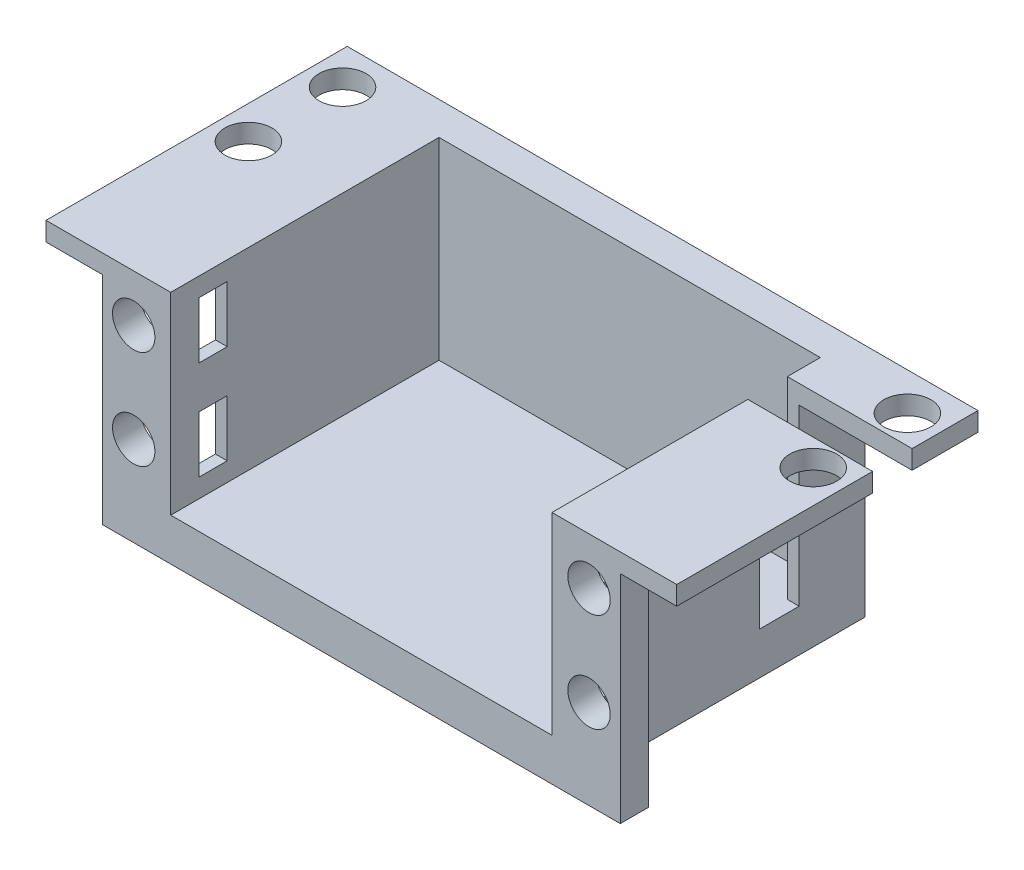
from build123d import *

# Parameters (mm, degrees)
SKETCH1_W                = 55
SKETCH1_H                = 32
BOSS_EXTRUDE1_DEPTH      = 25
SKETCH2_W                = 67
SKETCH2_H                = 32
BOSS_EXTRUDE2_DEPTH      = 2
SKETCH4_W                = 40.5
SKETCH4_H                = 28.5
CUT_EXTRUDE1_DEPTH       = 20.5
SKETCH5_R                = 2.25
CUT_EXTRUDE2_DEPTH       = 74.280283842
SKETCH6_R                = 2.5
CUT_EXTRUDE8_DEPTH       = 74.280283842
SKETCH7_W                = 6
SKETCH7_H                = 23
CUT_EXTRUDE9_DEPTH       = 29
CUT_EXTRUDE10_DEPTH      = 69.366658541
CUT_EXTRUDE10_DEPTH_BACK = 69.366658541
SKETCH8_W                = 3
SKETCH8_H                = 6
CUT_EXTRUDE11_DEPTH      = 74.280283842
CUT_EXTRUDE11_DEPTH_BACK = 20.5
SKETCH9_W                = 13.25
SKETCH9_H                = 4.2


with BuildPart() as part:
    # Sketch1 → Boss-Extrude1 (new body)
    with BuildSketch(Plane(origin=(0, 0, 0), x_dir=(1, 0, 0), z_dir=(0, 1, 0))):
        with Locations((27.5, 16)):
            Rectangle(SKETCH1_W, SKETCH1_H)
    extrude(amount=BOSS_EXTRUDE1_DEPTH)

    # Sketch2 → Boss-Extrude2 (add)
    with BuildSketch(Plane(origin=(0, 25, 0), x_dir=(1, 0, 0), z_dir=(0, 1, 0))):
        with Locations((27.5, 16)):
            Rectangle(SKETCH2_W, SKETCH2_H)
    extrude(amount=-BOSS_EXTRUDE2_DEPTH)

    # Sketch4 → Cut-Extrude1 (cut)
    with BuildSketch(Plane(origin=(0, 25, 0), x_dir=(1, 0, 0), z_dir=(0, 1, 0))):
        with Locations((27.5, 14.25)):
            Rectangle(SKETCH4_W, SKETCH4_H)
    extrude(amount=-CUT_EXTRUDE1_DEPTH, mode=Mode.SUBTRACT)

    # Sketch5 → Cut-Extrude2 (cut, through all)
    with BuildSketch(Plane.XY):
        with Locations((51.684373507, 20)):
            Circle(SKETCH5_R)
        with Locations((51.684373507, 9.5)):
            Circle(SKETCH5_R)
        with Locations(Location((3.315626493, 20, 0), (0, 0, 180))):
            Circle(SKETCH5_R)
        with Locations(Location((3.315626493, 9.5, 0), (0, 0, 180))):
            Circle(SKETCH5_R)
    extrude(amount=-CUT_EXTRUDE2_DEPTH, mode=Mode.SUBTRACT)

    # Sketch6 → Cut-Extrude8 (cut, through all)
    with BuildSketch(Plane(origin=(0, 25, 0), x_dir=(1, 0, 0), z_dir=(0, 1, 0))):
        with Locations(Location((-2.5, 28, 0), (0, 0, 270))):
            Circle(SKETCH6_R)
        with Locations(Location((-2.5, 18, 0), (0, 0, 270))):
            Circle(SKETCH6_R)
        with Locations(Location((57.5, 18, 0), (0, 0, 180))):
            Circle(SKETCH6_R)
        with Locations(Location((57.5, 28, 0), (0, 0, 180))):
            Circle(SKETCH6_R)
    extrude(amount=-CUT_EXTRUDE8_DEPTH, mode=Mode.SUBTRACT)

    # Sketch7 → Cut-Extrude9 (cut)
    with BuildSketch(Plane(origin=(0, 0, -32), x_dir=(-1, 0, 0), z_dir=(0, 0, -1))):
        with Locations((-52, 11.5)):
            Rectangle(SKETCH7_W, SKETCH7_H)
        with Locations((-3, 11.5)):
            Rectangle(SKETCH7_W, SKETCH7_H)
    extrude(amount=-CUT_EXTRUDE9_DEPTH, mode=Mode.SUBTRACT)

    # Sketch8 → Cut-Extrude10 (cut, two sides: drawn at the far end of the back side and taken through both)
    with BuildSketch(Plane(origin=(49, 0, 0), x_dir=(0, 0, -1), z_dir=(1, 0, 0)).offset(-CUT_EXTRUDE10_DEPTH_BACK)):
        with Locations((4.5, 9.5)):
            Rectangle(SKETCH8_W, SKETCH8_H)
        with Locations((4.5, 20)):
            Rectangle(SKETCH8_W, SKETCH8_H)
    extrude(amount=CUT_EXTRUDE10_DEPTH + CUT_EXTRUDE10_DEPTH_BACK, mode=Mode.SUBTRACT)

    # Sketch9 → Cut-Extrude11 (cut, two sides: drawn at the far end of the back side and taken through both)
    with BuildSketch(Plane(origin=(0, 25, 0), x_dir=(1, 0, 0), z_dir=(0, 1, 0)).offset(-CUT_EXTRUDE11_DEPTH_BACK)):
        with Locations((54.375, 22.9)):
            Rectangle(SKETCH9_W, SKETCH9_H)
    extrude(amount=CUT_EXTRUDE11_DEPTH + CUT_EXTRUDE11_DEPTH_BACK, mode=Mode.SUBTRACT)


solid = part.part
